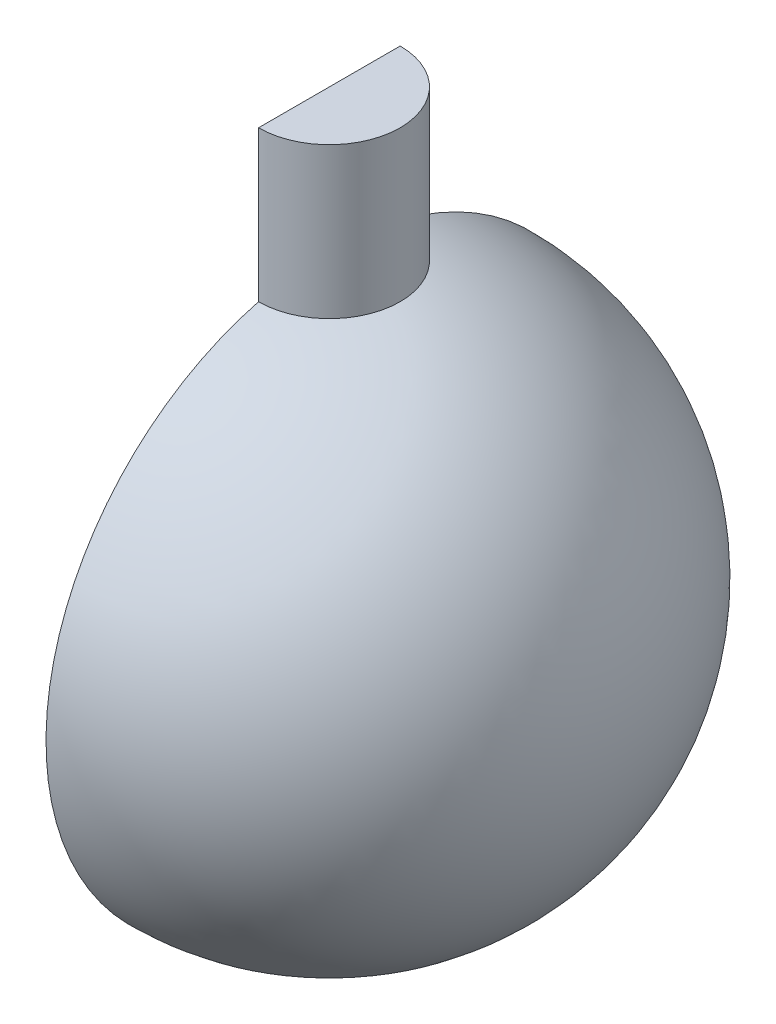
ISO-10303-21;
HEADER;
FILE_DESCRIPTION(('STEP AP214'),'2;1');
FILE_NAME('part.step','',(''),(''),'','','');
FILE_SCHEMA(('AUTOMOTIVE_DESIGN { 1 0 10303 214 1 1 1 1 }'));
ENDSEC;
DATA;
#1=APPLICATION_CONTEXT('core data for automotive mechanical design processes');
#2=APPLICATION_PROTOCOL_DEFINITION('international standard','automotive_design',2000,#1);
#3=PRODUCT_CONTEXT('',#1,'mechanical');
#4=PRODUCT('Part','Part','',(#3));
#5=PRODUCT_RELATED_PRODUCT_CATEGORY('part','',(#4));
#6=PRODUCT_DEFINITION_FORMATION('','',#4);
#7=PRODUCT_DEFINITION_CONTEXT('part definition',#1,'design');
#8=PRODUCT_DEFINITION('design','',#6,#7);
#9=PRODUCT_DEFINITION_SHAPE('','',#8);
#10=(LENGTH_UNIT() NAMED_UNIT(*) SI_UNIT(.MILLI.,.METRE.));
#11=(NAMED_UNIT(*) PLANE_ANGLE_UNIT() SI_UNIT($,.RADIAN.));
#12=(NAMED_UNIT(*) SI_UNIT($,.STERADIAN.) SOLID_ANGLE_UNIT());
#13=UNCERTAINTY_MEASURE_WITH_UNIT(LENGTH_MEASURE(1.E-05),#10,'distance_accuracy_value','');
#14=(GEOMETRIC_REPRESENTATION_CONTEXT(3) GLOBAL_UNCERTAINTY_ASSIGNED_CONTEXT((#13)) GLOBAL_UNIT_ASSIGNED_CONTEXT((#10,
#11,#12)) REPRESENTATION_CONTEXT('',''));
#15=CARTESIAN_POINT('',(0.,0.,0.));
#16=DIRECTION('',(0.,0.,1.));
#17=DIRECTION('',(1.,0.,0.));
#18=AXIS2_PLACEMENT_3D('',#15,#16,#17);
#19=CARTESIAN_POINT('',(0.,-38.101,0.));
#20=DIRECTION('',(0.,1.,0.));
#21=DIRECTION('',(0.,0.,1.));
#22=AXIS2_PLACEMENT_3D('',#19,#20,#21);
#23=CYLINDRICAL_SURFACE('',#22,9.525);
#24=DIRECTION('',(0.,1.,0.));
#25=VECTOR('',#24,1.);
#26=CARTESIAN_POINT('',(0.,-38.101,-9.525));
#27=LINE('',#26,#25);
#28=CARTESIAN_POINT('',(0.,57.15,-9.525));
#29=VERTEX_POINT('',#28);
#30=CARTESIAN_POINT('',(0.,36.8901663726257,-9.525));
#31=VERTEX_POINT('',#30);
#32=EDGE_CURVE('E51',#29,#31,#27,.F.);
#33=ORIENTED_EDGE('',*,*,#32,.F.);
#34=CARTESIAN_POINT('',(0.,57.15,0.));
#35=DIRECTION('',(0.,1.,0.));
#36=DIRECTION('',(0.,0.,1.));
#37=AXIS2_PLACEMENT_3D('',#34,#35,#36);
#38=CIRCLE('',#37,9.525);
#39=CARTESIAN_POINT('',(0.,57.15,9.525));
#40=VERTEX_POINT('',#39);
#41=EDGE_CURVE('E11',#40,#29,#38,.T.);
#42=ORIENTED_EDGE('',*,*,#41,.F.);
#43=DIRECTION('',(0.,1.,0.));
#44=VECTOR('',#43,1.);
#45=CARTESIAN_POINT('',(0.,-38.101,9.525));
#46=LINE('',#45,#44);
#47=CARTESIAN_POINT('',(0.,36.8901663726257,9.525));
#48=VERTEX_POINT('',#47);
#49=EDGE_CURVE('E64',#48,#40,#46,.T.);
#50=ORIENTED_EDGE('',*,*,#49,.F.);
#51=CARTESIAN_POINT('',(0.,36.8901663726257,0.));
#52=DIRECTION('',(0.,-1.,0.));
#53=DIRECTION('',(0.,0.,-1.));
#54=AXIS2_PLACEMENT_3D('',#51,#52,#53);
#55=CIRCLE('',#54,9.525);
#56=EDGE_CURVE('E44',#48,#31,#55,.F.);
#57=ORIENTED_EDGE('',*,*,#56,.T.);
#58=EDGE_LOOP('',(#33,#42,#50,#57));
#59=FACE_BOUND('',#58,.T.);
#60=ADVANCED_FACE('F35',(#59),#23,.T.);
#61=CARTESIAN_POINT('',(0.,57.15,0.));
#62=DIRECTION('',(0.,1.,0.));
#63=DIRECTION('',(0.,0.,1.));
#64=AXIS2_PLACEMENT_3D('',#61,#62,#63);
#65=PLANE('',#64);
#66=DIRECTION('',(0.,0.,-1.));
#67=VECTOR('',#66,1.);
#68=CARTESIAN_POINT('',(0.,57.15,0.));
#69=LINE('',#68,#67);
#70=EDGE_CURVE('E56',#40,#29,#69,.T.);
#71=ORIENTED_EDGE('',*,*,#70,.F.);
#72=ORIENTED_EDGE('',*,*,#41,.T.);
#73=EDGE_LOOP('',(#71,#72));
#74=FACE_BOUND('',#73,.T.);
#75=ADVANCED_FACE('F77',(#74),#65,.T.);
#76=CARTESIAN_POINT('',(0.,0.,0.));
#77=DIRECTION('',(0.,-1.,0.));
#78=DIRECTION('',(-1.,0.,0.));
#79=AXIS2_PLACEMENT_3D('',#76,#77,#78);
#80=SPHERICAL_SURFACE('',#79,38.1);
#81=ORIENTED_EDGE('',*,*,#56,.F.);
#82=CARTESIAN_POINT('',(0.,0.,0.));
#83=DIRECTION('',(1.,0.,0.));
#84=DIRECTION('',(0.,0.,-1.));
#85=AXIS2_PLACEMENT_3D('',#82,#83,#84);
#86=CIRCLE('',#85,38.1);
#87=EDGE_CURVE('E60',#48,#31,#86,.T.);
#88=ORIENTED_EDGE('',*,*,#87,.T.);
#89=EDGE_LOOP('',(#81,#88));
#90=FACE_BOUND('',#89,.T.);
#91=ADVANCED_FACE('F72',(#90),#80,.T.);
#92=CARTESIAN_POINT('',(0.,0.,0.));
#93=DIRECTION('',(1.,0.,0.));
#94=DIRECTION('',(0.,0.,-1.));
#95=AXIS2_PLACEMENT_3D('',#92,#93,#94);
#96=PLANE('',#95);
#97=ORIENTED_EDGE('',*,*,#70,.T.);
#98=ORIENTED_EDGE('',*,*,#32,.T.);
#99=ORIENTED_EDGE('',*,*,#87,.F.);
#100=ORIENTED_EDGE('',*,*,#49,.T.);
#101=EDGE_LOOP('',(#97,#98,#99,#100));
#102=FACE_BOUND('',#101,.T.);
#103=CARTESIAN_POINT('',(0.,0.,0.));
#104=DIRECTION('',(1.,0.,0.));
#105=DIRECTION('',(0.,0.,-1.));
#106=AXIS2_PLACEMENT_3D('',#103,#104,#105);
#107=CIRCLE('',#106,29.6333333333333);
#108=CARTESIAN_POINT('',(0.,0.,-29.6333333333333));
#109=VERTEX_POINT('',#108);
#110=EDGE_CURVE('E39',#109,#109,#107,.F.);
#111=ORIENTED_EDGE('',*,*,#110,.F.);
#112=EDGE_LOOP('',(#111));
#113=FACE_BOUND('',#112,.T.);
#114=ADVANCED_FACE('F62',(#102,#113),#96,.F.);
#115=CARTESIAN_POINT('',(0.,0.,0.));
#116=DIRECTION('',(0.,-1.,0.));
#117=DIRECTION('',(1.,0.,0.));
#118=AXIS2_PLACEMENT_3D('',#115,#116,#117);
#119=SPHERICAL_SURFACE('',#118,29.6333333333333);
#120=CARTESIAN_POINT('',(0.,0.,0.));
#121=DIRECTION('',(1.,0.,0.));
#122=DIRECTION('',(0.,0.,-1.));
#123=AXIS2_PLACEMENT_3D('',#120,#121,#122);
#124=SPHERICAL_SURFACE('',#123,29.6333333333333);
#125=ORIENTED_EDGE('',*,*,#110,.T.);
#126=EDGE_LOOP('',(#125));
#127=FACE_BOUND('',#126,.T.);
#128=ADVANCED_FACE('F37',(#127),#124,.F.);
#129=CLOSED_SHELL('',(#60,#75,#91,#114,#128));
#130=MANIFOLD_SOLID_BREP('B2',#129);
#131=ADVANCED_BREP_SHAPE_REPRESENTATION('',(#18,#130),#14);
#132=SHAPE_DEFINITION_REPRESENTATION(#9,#131);
ENDSEC;
END-ISO-10303-21;
